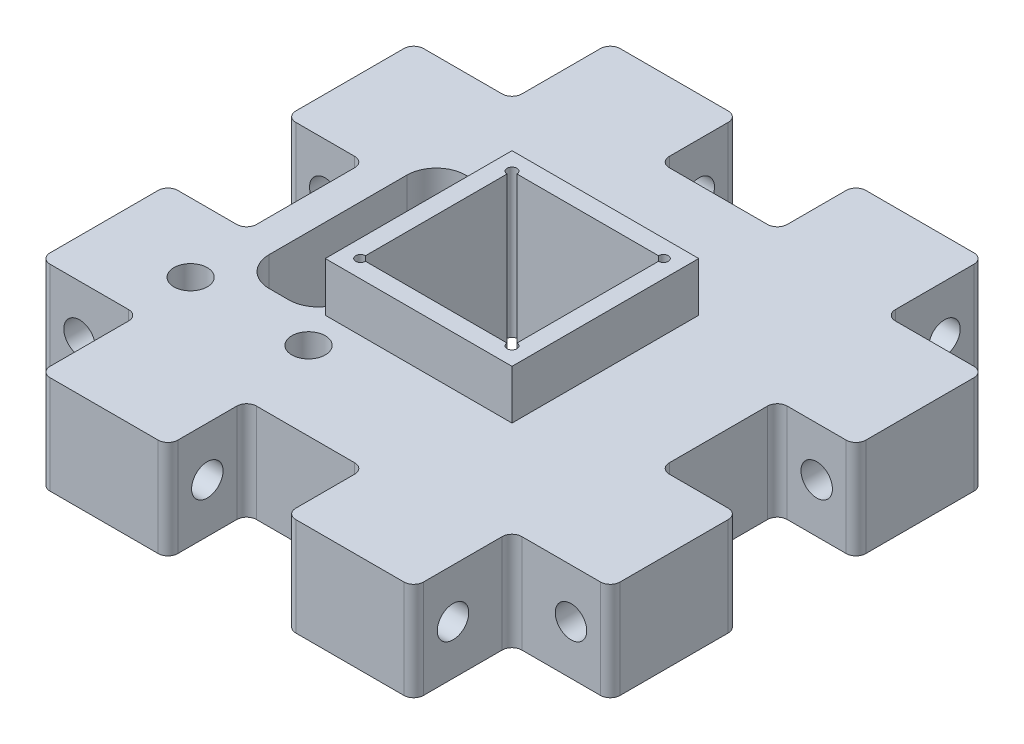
from build123d import *
from build123d.topology import SkipClean

# Parameters (mm, degrees)
SKETCH_1_W              = 58
SKETCH_1_H              = 58
SKETCH_1_W_2            = 15.4
SKETCH_1_H_2            = 15.4
EXTRUDE_1_DEPTH         = 10
CUT_EXTRUDE_1_REACH     = 44.214
SKETCH_2_W              = 12
SKETCH_2_H              = 8
SKETCH_2_W_2            = 8
SKETCH_2_H_2            = 12
CUT_EXTRUDE_2_REACH     = 67.612
SKETCH_4_R              = 1.6
CUT_EXTRUDE_3_REACH     = 67.612
SKETCH_5_R              = 1.6
CUT_EXTRUDE_4_REACH     = 67.612
SKETCH_6_R              = 1.6
CUT_EXTRUDE_5_REACH     = 67.612
SKETCH_7_R              = 1.6
CUT_EXTRUDE_6_REACH     = 44.214
SKETCH_8_W              = 8
SKETCH_8_H              = 20
CUT_EXTRUDE_7_REACH     = 44.214
SKETCH_9_R              = 0.5
SKETCH_10_W             = 19
SKETCH_10_H             = 19
EXTRUDE_2_DEPTH         = 5
CUT_EXTRUDE_8_REACH     = 45.669
SKETCH_12_W             = 10
SKETCH_12_H             = 10
FILLET_2_R              = 1
HOLE_WIZARD_3_4_3_4_1_D = 3.4
FILLET_3_R              = 3
FILLET_4_R              = 1
CUT_EXTRUDE_9_DEPTH     = 2.4


with BuildPart() as part:
    # Sketch 1 → Extrude 1 (new body)
    with BuildSketch(Plane(origin=(0, 0, 0), x_dir=(1, 0, 0), z_dir=(0, 1, 0))):
        Rectangle(SKETCH_1_W, SKETCH_1_H)
        Rectangle(SKETCH_1_W_2, SKETCH_1_H_2, mode=Mode.SUBTRACT)
    extrude(amount=EXTRUDE_1_DEPTH)

    # Sketch 2 → Cut-Extrude 1 (cut, up to next)
    with BuildSketch(Plane(origin=(0, 10, 0), x_dir=(1, 0, 0), z_dir=(0, 1, 0)), mode=Mode.PRIVATE) as cut_extrude_1_sk1:
        with Locations((0, 25)):
            Rectangle(SKETCH_2_W, SKETCH_2_H)
    cut_extrude_1_tool1 = extrude(cut_extrude_1_sk1.sketch, amount=-CUT_EXTRUDE_1_REACH, mode=Mode.PRIVATE) & part.part
    # Sketch 2 → Cut-Extrude 1 (cut, up to next)
    with BuildSketch(Plane(origin=(0, 10, 0), x_dir=(1, 0, 0), z_dir=(0, 1, 0)), mode=Mode.PRIVATE) as cut_extrude_1_sk2:
        with Locations((25, 0)):
            Rectangle(SKETCH_2_W_2, SKETCH_2_H_2)
    cut_extrude_1_tool2 = extrude(cut_extrude_1_sk2.sketch, amount=-CUT_EXTRUDE_1_REACH, mode=Mode.PRIVATE) & part.part
    # Sketch 2 → Cut-Extrude 1 (cut, up to next)
    with BuildSketch(Plane(origin=(0, 10, 0), x_dir=(1, 0, 0), z_dir=(0, 1, 0)), mode=Mode.PRIVATE) as cut_extrude_1_sk3:
        with Locations((0, -25)):
            Rectangle(SKETCH_2_W, SKETCH_2_H)
    cut_extrude_1_tool3 = extrude(cut_extrude_1_sk3.sketch, amount=-CUT_EXTRUDE_1_REACH, mode=Mode.PRIVATE) & part.part
    # Sketch 2 → Cut-Extrude 1 (cut, up to next)
    with BuildSketch(Plane(origin=(0, 10, 0), x_dir=(1, 0, 0), z_dir=(0, 1, 0)), mode=Mode.PRIVATE) as cut_extrude_1_sk4:
        with Locations((-25, 0)):
            Rectangle(SKETCH_2_W_2, SKETCH_2_H_2)
    cut_extrude_1_tool4 = extrude(cut_extrude_1_sk4.sketch, amount=-CUT_EXTRUDE_1_REACH, mode=Mode.PRIVATE) & part.part
    add(cut_extrude_1_tool1.solids().sort_by_distance((0, 10, -25))[0], mode=Mode.SUBTRACT)
    add(cut_extrude_1_tool2.solids().sort_by_distance((25, 10, 0))[0], mode=Mode.SUBTRACT)
    add(cut_extrude_1_tool3.solids().sort_by_distance((0, 10, 25))[0], mode=Mode.SUBTRACT)
    add(cut_extrude_1_tool4.solids().sort_by_distance((-25, 10, 0))[0], mode=Mode.SUBTRACT)

    # Cut-Extrude 2: up to this face of the body (flat: up to its plane)
    cut_extrude_2_end = Plane(part.part.faces().sort_by_distance((29, 5, -17.5))[0])
    # Sketch 4 → Cut-Extrude 2 (cut, up to the picked face)
    with BuildSketch(Plane.ZY.offset(29), mode=Mode.PRIVATE) as cut_extrude_2_sk1:
        with Locations((-25, 5)):
            Circle(SKETCH_4_R)
    cut_extrude_2_tool1 = split(extrude(cut_extrude_2_sk1.sketch, amount=-CUT_EXTRUDE_2_REACH, mode=Mode.PRIVATE), bisect_by=cut_extrude_2_end, keep=Keep.BOTH, mode=Mode.PRIVATE)
    add(cut_extrude_2_tool1.solids().sort_by(Axis((-29, 5, -25), (1, 0, 0)))[0], mode=Mode.SUBTRACT)

    # Cut-Extrude 3: up to this face of the body (flat: up to its plane)
    cut_extrude_3_end = Plane(part.part.faces().sort_by_distance((-17.5, 5, 29))[0])
    # Sketch 5 → Cut-Extrude 3 (cut, up to the picked face)
    with BuildSketch(Plane(origin=(0, 0, -29), x_dir=(-1, 0, 0), z_dir=(0, 0, -1)), mode=Mode.PRIVATE) as cut_extrude_3_sk1:
        with Locations((25, 5)):
            Circle(SKETCH_5_R)
    cut_extrude_3_tool1 = split(extrude(cut_extrude_3_sk1.sketch, amount=-CUT_EXTRUDE_3_REACH, mode=Mode.PRIVATE), bisect_by=cut_extrude_3_end, keep=Keep.BOTH, mode=Mode.PRIVATE)
    add(cut_extrude_3_tool1.solids().sort_by(Axis((-25, 5, -29), (0, 0, 1)))[0], mode=Mode.SUBTRACT)

    # Cut-Extrude 4: up to this face of the body (flat: up to its plane)
    cut_extrude_4_end = Plane(part.part.faces().sort_by_distance((29, 5, 17.5))[0])
    # Sketch 6 → Cut-Extrude 4 (cut, up to the picked face)
    with BuildSketch(Plane.ZY.offset(29), mode=Mode.PRIVATE) as cut_extrude_4_sk1:
        with Locations((25, 5)):
            Circle(SKETCH_6_R)
    cut_extrude_4_tool1 = split(extrude(cut_extrude_4_sk1.sketch, amount=-CUT_EXTRUDE_4_REACH, mode=Mode.PRIVATE), bisect_by=cut_extrude_4_end, keep=Keep.BOTH, mode=Mode.PRIVATE)
    add(cut_extrude_4_tool1.solids().sort_by(Axis((-29, 5, 25), (1, 0, 0)))[0], mode=Mode.SUBTRACT)

    # Cut-Extrude 5: up to this face of the body (flat: up to its plane)
    cut_extrude_5_end = Plane(part.part.faces().sort_by_distance((17.5, 5, -29))[0])
    # Sketch 7 → Cut-Extrude 5 (cut, up to the picked face)
    with BuildSketch(Plane.XY.offset(29), mode=Mode.PRIVATE) as cut_extrude_5_sk1:
        with Locations((25, 5)):
            Circle(SKETCH_7_R)
    cut_extrude_5_tool1 = split(extrude(cut_extrude_5_sk1.sketch, amount=-CUT_EXTRUDE_5_REACH, mode=Mode.PRIVATE), bisect_by=cut_extrude_5_end, keep=Keep.BOTH, mode=Mode.PRIVATE)
    add(cut_extrude_5_tool1.solids().sort_by(Axis((25, 5, 29), (0, 0, -1)))[0], mode=Mode.SUBTRACT)

    # Sketch 8 → Cut-Extrude 6 (cut, up to next)
    with BuildSketch(Plane.XZ, mode=Mode.PRIVATE) as cut_extrude_6_sk1:
        with Locations((-13.7, 0)):
            Rectangle(SKETCH_8_W, SKETCH_8_H)
    cut_extrude_6_tool1 = extrude(cut_extrude_6_sk1.sketch, amount=-CUT_EXTRUDE_6_REACH, mode=Mode.PRIVATE) & part.part
    add(cut_extrude_6_tool1.solids().sort_by_distance((-13.7, 0, 0))[0], mode=Mode.SUBTRACT)

    # Sketch 9 → Cut-Extrude 7 (cut, up to next)
    with BuildSketch(Plane(origin=(0, 0, 0), x_dir=(-1, 0, 0), z_dir=(0, -1, 0)), mode=Mode.PRIVATE) as cut_extrude_7_sk1:
        with Locations((-7.7, -7.7)):
            Circle(SKETCH_9_R)
    cut_extrude_7_tool1 = extrude(cut_extrude_7_sk1.sketch, amount=-CUT_EXTRUDE_7_REACH, mode=Mode.PRIVATE) & part.part
    # Sketch 9 → Cut-Extrude 7 (cut, up to next)
    with BuildSketch(Plane(origin=(0, 0, 0), x_dir=(-1, 0, 0), z_dir=(0, -1, 0)), mode=Mode.PRIVATE) as cut_extrude_7_sk2:
        with Locations((-7.7, 7.7)):
            Circle(SKETCH_9_R)
    cut_extrude_7_tool2 = extrude(cut_extrude_7_sk2.sketch, amount=-CUT_EXTRUDE_7_REACH, mode=Mode.PRIVATE) & part.part
    # Sketch 9 → Cut-Extrude 7 (cut, up to next)
    with BuildSketch(Plane(origin=(0, 0, 0), x_dir=(-1, 0, 0), z_dir=(0, -1, 0)), mode=Mode.PRIVATE) as cut_extrude_7_sk3:
        with Locations((7.7, 7.7)):
            Circle(SKETCH_9_R)
    cut_extrude_7_tool3 = extrude(cut_extrude_7_sk3.sketch, amount=-CUT_EXTRUDE_7_REACH, mode=Mode.PRIVATE) & part.part
    # Sketch 9 → Cut-Extrude 7 (cut, up to next)
    with BuildSketch(Plane(origin=(0, 0, 0), x_dir=(-1, 0, 0), z_dir=(0, -1, 0)), mode=Mode.PRIVATE) as cut_extrude_7_sk4:
        with Locations((7.7, -7.7)):
            Circle(SKETCH_9_R)
    cut_extrude_7_tool4 = extrude(cut_extrude_7_sk4.sketch, amount=-CUT_EXTRUDE_7_REACH, mode=Mode.PRIVATE) & part.part
    add(cut_extrude_7_tool1.solids().sort_by_distance((7.7, 0, 7.7))[0], mode=Mode.SUBTRACT)
    add(cut_extrude_7_tool2.solids().sort_by_distance((7.7, 0, -7.7))[0], mode=Mode.SUBTRACT)
    add(cut_extrude_7_tool3.solids().sort_by_distance((-7.7, 0, -7.7))[0], mode=Mode.SUBTRACT)
    add(cut_extrude_7_tool4.solids().sort_by_distance((-7.7, 0, 7.7))[0], mode=Mode.SUBTRACT)

    # Sketch 10 → Extrude 2 (add)
    with SkipClean():  # the faces are left unmerged after this step: merging them gives an invalid solid
        with BuildSketch(Plane(origin=(0, 10, 0), x_dir=(1, 0, 0), z_dir=(0, 1, 0))):
            Rectangle(SKETCH_10_W, SKETCH_10_H)
            with BuildLine():
                Line((7.2, 7.7), (-7.2, 7.7))
                ThreePointArc((-7.2, 7.7), (-8.053553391, 8.053553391), (-7.7, 7.2))
                Line((-7.7, 7.2), (-7.7, -7.2))
                ThreePointArc((-7.7, -7.2), (-8.053553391, -8.053553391), (-7.2, -7.7))
                Line((-7.2, -7.7), (7.2, -7.7))
                ThreePointArc((7.2, -7.7), (8.053553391, -8.053553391), (7.7, -7.2))
                Line((7.7, -7.2), (7.7, 7.2))
                ThreePointArc((7.7, 7.2), (8.053553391, 8.053553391), (7.2, 7.7))
            make_face(mode=Mode.SUBTRACT)
        extrude(amount=EXTRUDE_2_DEPTH)

    # Sketch 12 → Cut-Extrude 8 (cut, up to next)
    with BuildSketch(Plane.XZ, mode=Mode.PRIVATE) as cut_extrude_8_sk1:
        with Locations((-24, 24)):
            Rectangle(SKETCH_12_W, SKETCH_12_H)
    cut_extrude_8_tool1 = extrude(cut_extrude_8_sk1.sketch, amount=-CUT_EXTRUDE_8_REACH, mode=Mode.PRIVATE) & part.part
    # Sketch 12 → Cut-Extrude 8 (cut, up to next)
    with BuildSketch(Plane.XZ, mode=Mode.PRIVATE) as cut_extrude_8_sk2:
        with Locations((24, 24)):
            Rectangle(SKETCH_12_W, SKETCH_12_H)
    cut_extrude_8_tool2 = extrude(cut_extrude_8_sk2.sketch, amount=-CUT_EXTRUDE_8_REACH, mode=Mode.PRIVATE) & part.part
    # Sketch 12 → Cut-Extrude 8 (cut, up to next)
    with BuildSketch(Plane.XZ, mode=Mode.PRIVATE) as cut_extrude_8_sk3:
        with Locations((24, -24)):
            Rectangle(SKETCH_12_W, SKETCH_12_H)
    cut_extrude_8_tool3 = extrude(cut_extrude_8_sk3.sketch, amount=-CUT_EXTRUDE_8_REACH, mode=Mode.PRIVATE) & part.part
    # Sketch 12 → Cut-Extrude 8 (cut, up to next)
    with BuildSketch(Plane.XZ, mode=Mode.PRIVATE) as cut_extrude_8_sk4:
        with Locations((-24, -24)):
            Rectangle(SKETCH_12_W, SKETCH_12_H)
    cut_extrude_8_tool4 = extrude(cut_extrude_8_sk4.sketch, amount=-CUT_EXTRUDE_8_REACH, mode=Mode.PRIVATE) & part.part
    add(cut_extrude_8_tool1.solids().sort_by_distance((-24, 0, 24))[0], mode=Mode.SUBTRACT)
    add(cut_extrude_8_tool2.solids().sort_by_distance((24, 0, 24))[0], mode=Mode.SUBTRACT)
    add(cut_extrude_8_tool3.solids().sort_by_distance((24, 0, -24))[0], mode=Mode.SUBTRACT)
    add(cut_extrude_8_tool4.solids().sort_by_distance((-24, 0, -24))[0], mode=Mode.SUBTRACT)

    # Fillet 2
    fillet_2_edges = [part.edges().sort_by_distance(p)[0] for p in [
        (-29, 5, 19),
        (-19, 5, 29),
        (29, 5, 19),
        (19, 5, 29),
        (19, 5, -29),
        (29, 5, -19),
        (-29, 5, -19),
        (-19, 5, -29),
        (-6, 5, -29),
        (6, 5, -29),
        (29, 5, -6),
        (29, 5, 6),
        (6, 5, 29),
        (-6, 5, 29),
        (-29, 5, 6),
        (-29, 5, -6),
    ]]
    fillet(fillet_2_edges, radius=FILLET_2_R)

    # Hole Wizard 3.4 _3.4_ _1 (through all)
    with Locations(Plane(origin=(0, 10, 0), x_dir=(1, 0, 0), z_dir=(0, 1, 0))):
        with Locations((-19.7, -13), (-7.7, -13)):
            Hole(HOLE_WIZARD_3_4_3_4_1_D / 2)

    # Fillet 3
    fillet_3_edges = [part.edges().sort_by_distance(p)[0] for p in [
        (-9.7, 5, 10),
        (-9.7, 5, -10),
        (-17.7, 5, -10),
        (-17.7, 5, 10),
    ]]
    fillet(fillet_3_edges, radius=FILLET_3_R)

    # Fillet 4
    fillet_4_edges = [part.edges().sort_by_distance(p)[0] for p in [
        (-19, 5, 19),
        (19, 5, 19),
        (19, 5, -19),
        (-19, 5, -19),
        (-6, 5, -21),
        (6, 5, -21),
        (21, 5, 6),
        (21, 5, -6),
        (6, 5, 21),
        (-6, 5, 21),
        (-21, 5, 6),
        (-21, 5, -6),
    ]]
    fillet(fillet_4_edges, radius=FILLET_4_R)

    # Sketch 15 → Cut-Extrude 9 (cut)
    with SkipClean():  # the faces are left unmerged after this step: merging them gives an invalid solid
        with BuildSketch(Plane.XZ):
            Polygon((-17.967949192, 16), (-21.432050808, 16), (-23.164101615, 13), (-21.432050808, 10), (-17.967949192, 10), (-16.235898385, 13), align=None)
            Polygon((-5.967949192, 16), (-9.432050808, 16), (-11.164101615, 13), (-9.432050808, 10), (-5.967949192, 10), (-4.235898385, 13), align=None)
        extrude(amount=-CUT_EXTRUDE_9_DEPTH, mode=Mode.SUBTRACT)


solid = part.part
